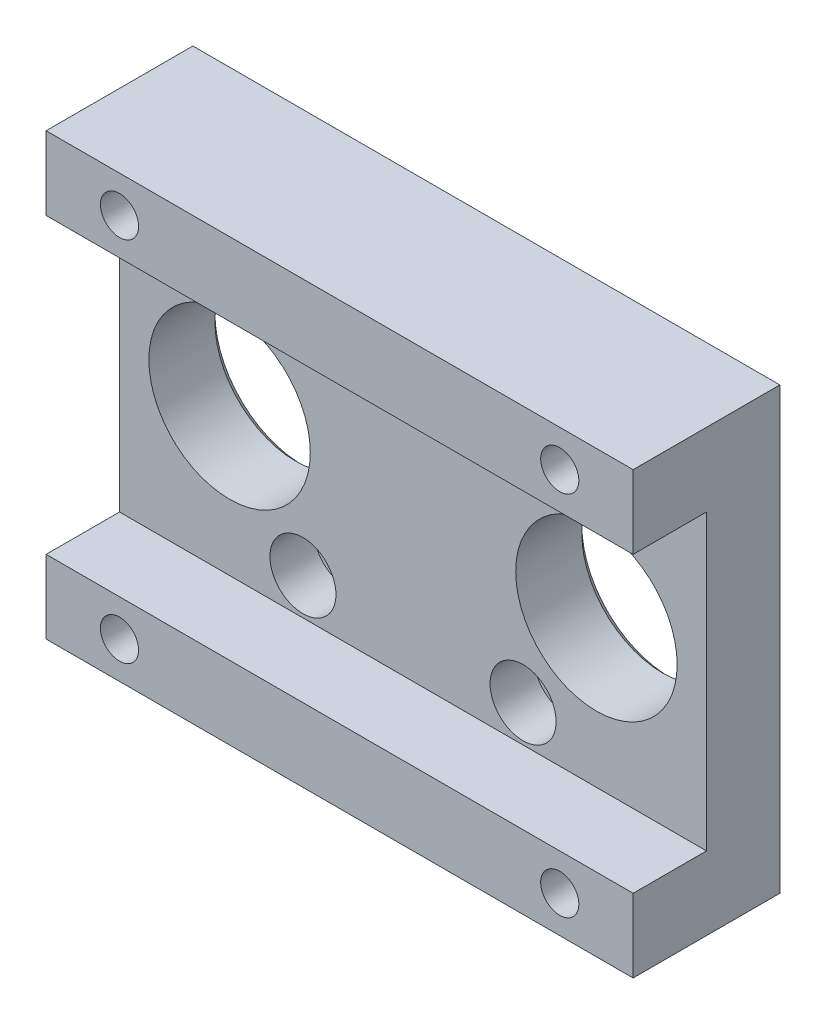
from build123d import *

# Parameters (mm, degrees)
SKIZZE1_W                       = 80
SKIZZE1_H                       = 60
AUFSATZ_LINEAR_AUSTRAGEN1_DEPTH = 10
SKIZZE2_W                       = 80
SKIZZE2_H                       = 10
AUFSATZ_LINEAR_AUSTRAGEN2_DEPTH = 10
SKIZZE5_R                       = 2.6
SCHNITT_LINEAR_AUSTRAGEN3_DEPTH = 20
SKIZZE6_R                       = 11
SCHNITT_LINEAR_AUSTRAGEN4_DEPTH = 12.2
FASE1_SIZE                      = 1
SKIZZE7_R                       = 4.5
SCHNITT_LINEAR_AUSTRAGEN5_DEPTH = 5.3
SKIZZE8_R                       = 2.6
SCHNITT_LINEAR_AUSTRAGEN6_DEPTH = 10
SKIZZE9_R                       = 4.5
SCHNITT_LINEAR_AUSTRAGEN7_DEPTH = 6


with BuildPart() as part:
    # Skizze1 → Aufsatz-Linear austragen1 (new body)
    with BuildSketch(Plane.XY):
        Rectangle(SKIZZE1_W, SKIZZE1_H)
    extrude(amount=AUFSATZ_LINEAR_AUSTRAGEN1_DEPTH)

    # Skizze2 → Aufsatz-Linear austragen2 (add)
    with BuildSketch(Plane.XY.offset(10)):
        with Locations((0, 25)):
            Rectangle(SKIZZE2_W, SKIZZE2_H)
        with Locations((0, -25)):
            Rectangle(SKIZZE2_W, SKIZZE2_H)
    extrude(amount=AUFSATZ_LINEAR_AUSTRAGEN2_DEPTH)

    # Skizze5 → Schnitt-Linear austragen3 (cut)
    with BuildSketch(Plane.XY.offset(20)):
        with Locations((30, 25)):
            Circle(SKIZZE5_R)
        with Locations((-30, 25)):
            Circle(SKIZZE5_R)
        with Locations((-30, -25)):
            Circle(SKIZZE5_R)
        with Locations((30, -25)):
            Circle(SKIZZE5_R)
    extrude(amount=-SCHNITT_LINEAR_AUSTRAGEN3_DEPTH, mode=Mode.SUBTRACT)

    # Skizze6 → Schnitt-Linear austragen4 (cut)
    with BuildSketch(Plane.XY.offset(10)):
        with Locations((-25, 0)):
            Circle(SKIZZE6_R)
        with Locations((25, 0)):
            Circle(SKIZZE6_R)
    extrude(amount=-SCHNITT_LINEAR_AUSTRAGEN4_DEPTH, mode=Mode.SUBTRACT)

    # Fase1
    fase1_edges = [part.edges().sort_by_distance(p)[0] for p in [
        (-36, 0, 0),
        (14, 0, 0),
    ]]
    chamfer(fase1_edges, length=FASE1_SIZE)

    # Skizze7 → Schnitt-Linear austragen5 (cut)
    with BuildSketch(Plane(origin=(0, 0, 0), x_dir=(-1, 0, 0), z_dir=(0, 0, -1))):
        with Locations((-30, 25)):
            Circle(SKIZZE7_R)
        with Locations((30, 25)):
            Circle(SKIZZE7_R)
        with Locations((30, -25)):
            Circle(SKIZZE7_R)
        with Locations((-30, -25)):
            Circle(SKIZZE7_R)
    extrude(amount=-SCHNITT_LINEAR_AUSTRAGEN5_DEPTH, mode=Mode.SUBTRACT)

    # Skizze8 → Schnitt-Linear austragen6 (cut)
    with BuildSketch(Plane(origin=(0, 0, 0), x_dir=(-1, 0, 0), z_dir=(0, 0, -1))):
        with Locations((-15, 15)):
            Circle(SKIZZE8_R)
        with Locations((15, 15)):
            Circle(SKIZZE8_R)
        with Locations((15, -15)):
            Circle(SKIZZE8_R)
        with Locations((-15, -15)):
            Circle(SKIZZE8_R)
    extrude(amount=-SCHNITT_LINEAR_AUSTRAGEN6_DEPTH, mode=Mode.SUBTRACT)

    # Skizze9 → Schnitt-Linear austragen7 (cut)
    with BuildSketch(Plane.XY.offset(10)):
        with Locations((15, 15)):
            Circle(SKIZZE9_R)
        with Locations((-15, 15)):
            Circle(SKIZZE9_R)
        with Locations((-15, -15)):
            Circle(SKIZZE9_R)
        with Locations((15, -15)):
            Circle(SKIZZE9_R)
    extrude(amount=-SCHNITT_LINEAR_AUSTRAGEN7_DEPTH, mode=Mode.SUBTRACT)


solid = part.part
